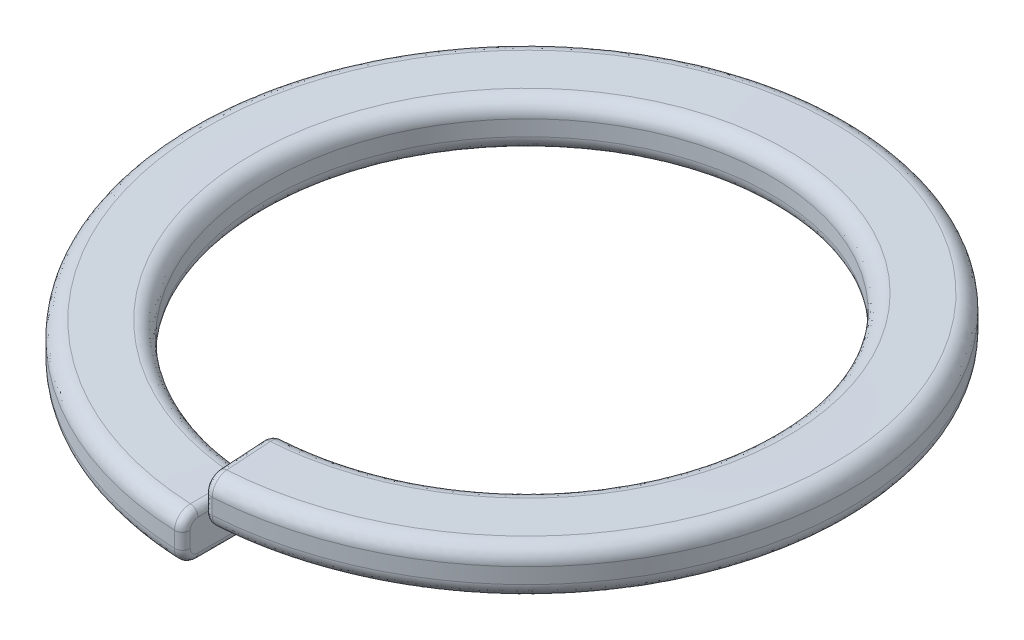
from build123d import *

# Parameters (mm, degrees)
SWEEP2_PITCH  = 0.606060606
SWEEP2_HEIGHT = 0.6
SWEEP2_RADIUS = 3.25
FILLET4_R     = 0.1


with BuildPart() as part:
    # Sweep2: sweep along a helix
    with BuildLine() as sweep2_path:
        Helix(SWEEP2_PITCH, SWEEP2_HEIGHT, SWEEP2_RADIUS, center=(0, 0, 0), direction=(0, 1, 0), lefthand=True)
    # Sketch2 → Sweep2 (sweep)
    with BuildSketch(Plane(origin=(0, 0, 0), x_dir=(0, 0, -1), z_dir=(1, 0, 0))):
        with BuildLine():
            Line((-3.443586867, 0.6), (-4.043586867, 0.6))
            ThreePointArc((-4.043586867, 0.6), (-4.185008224, 0.658578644), (-4.243586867, 0.8))
            Line((-4.243586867, 0.8), (-4.243586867, 1))
            ThreePointArc((-4.243586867, 1), (-4.185008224, 1.141421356), (-4.043586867, 1.2))
            Line((-4.043586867, 1.2), (-3.443586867, 1.2))
            ThreePointArc((-3.443586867, 1.2), (-3.302165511, 1.141421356), (-3.243586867, 1))
            Line((-3.243586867, 1), (-3.243586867, 0.8))
            ThreePointArc((-3.243586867, 0.8), (-3.302165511, 0.658578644), (-3.443586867, 0.6))
        make_face()
    sweep(path=sweep2_path.line, is_frenet=True)

    # Fillet4
    fillet4_edges = [part.edges().sort_by_distance(p)[0] for p in [
        (0.266457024, 1.5, 4.235213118),
        (0.262778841, 1.258578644, 4.176750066),
        (0.235061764, 1.2, 3.736199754),
        (0.207344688, 1.258578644, 3.295649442),
        (0.203666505, 1.5, 3.23718639),
        (0.207344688, 1.741421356, 3.295649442),
        (0.235061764, 1.8, 3.736199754),
        (0.262778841, 1.741421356, 4.176750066),
        (0, 1.2, 3.743586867),
        (0, 1.141421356, 3.302165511),
        (0, 0.9, 3.243586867),
        (0, 0.658578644, 3.302165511),
        (0, 0.6, 3.743586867),
        (0, 0.658578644, 4.185008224),
        (0, 0.9, 4.243586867),
        (0, 1.141421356, 4.185008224),
    ]]
    fillet(fillet4_edges, radius=FILLET4_R)


solid = part.part
